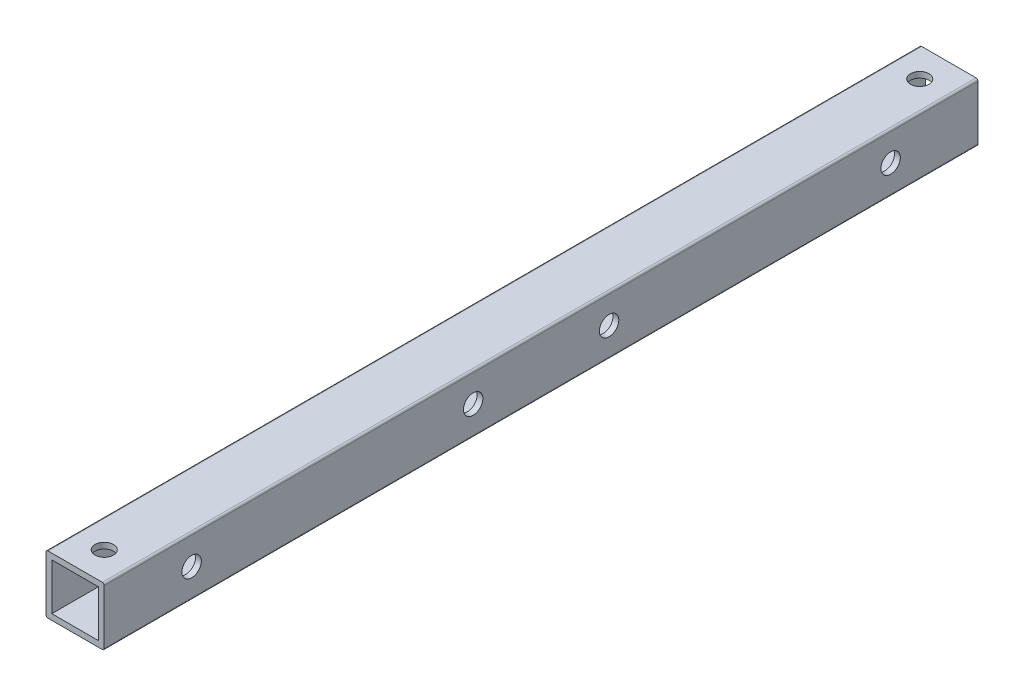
ISO-10303-21;
HEADER;
FILE_DESCRIPTION(('STEP AP214'),'2;1');
FILE_NAME('part.step','',(''),(''),'','','');
FILE_SCHEMA(('AUTOMOTIVE_DESIGN { 1 0 10303 214 1 1 1 1 }'));
ENDSEC;
DATA;
#1=APPLICATION_CONTEXT('core data for automotive mechanical design processes');
#2=APPLICATION_PROTOCOL_DEFINITION('international standard','automotive_design',2000,#1);
#3=PRODUCT_CONTEXT('',#1,'mechanical');
#4=PRODUCT('Part','Part','',(#3));
#5=PRODUCT_RELATED_PRODUCT_CATEGORY('part','',(#4));
#6=PRODUCT_DEFINITION_FORMATION('','',#4);
#7=PRODUCT_DEFINITION_CONTEXT('part definition',#1,'design');
#8=PRODUCT_DEFINITION('design','',#6,#7);
#9=PRODUCT_DEFINITION_SHAPE('','',#8);
#10=(LENGTH_UNIT() NAMED_UNIT(*) SI_UNIT(.MILLI.,.METRE.));
#11=(NAMED_UNIT(*) PLANE_ANGLE_UNIT() SI_UNIT($,.RADIAN.));
#12=(NAMED_UNIT(*) SI_UNIT($,.STERADIAN.) SOLID_ANGLE_UNIT());
#13=UNCERTAINTY_MEASURE_WITH_UNIT(LENGTH_MEASURE(1.E-05),#10,'distance_accuracy_value','');
#14=(GEOMETRIC_REPRESENTATION_CONTEXT(3) GLOBAL_UNCERTAINTY_ASSIGNED_CONTEXT((#13)) GLOBAL_UNIT_ASSIGNED_CONTEXT((#10,
#11,#12)) REPRESENTATION_CONTEXT('',''));
#15=CARTESIAN_POINT('',(0.,0.,0.));
#16=DIRECTION('',(0.,0.,1.));
#17=DIRECTION('',(1.,0.,0.));
#18=AXIS2_PLACEMENT_3D('',#15,#16,#17);
#19=CARTESIAN_POINT('',(-14.,-14.,450.));
#20=DIRECTION('',(0.,0.,-1.));
#21=DIRECTION('',(-1.,0.,0.));
#22=AXIS2_PLACEMENT_3D('',#19,#20,#21);
#23=PLANE('',#22);
#24=CARTESIAN_POINT('',(-14.,-14.,450.));
#25=DIRECTION('',(0.,0.,-1.));
#26=DIRECTION('',(-1.,0.,0.));
#27=AXIS2_PLACEMENT_3D('',#24,#25,#26);
#28=CIRCLE('',#27,0.999999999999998);
#29=CARTESIAN_POINT('',(-14.,-15.,450.));
#30=VERTEX_POINT('',#29);
#31=CARTESIAN_POINT('',(-15.,-14.,450.));
#32=VERTEX_POINT('',#31);
#33=EDGE_CURVE('E184',#30,#32,#28,.T.);
#34=ORIENTED_EDGE('',*,*,#33,.F.);
#35=DIRECTION('',(-1.,0.,0.));
#36=VECTOR('',#35,1.);
#37=CARTESIAN_POINT('',(14.,-15.,450.));
#38=LINE('',#37,#36);
#39=CARTESIAN_POINT('',(14.,-15.,450.));
#40=VERTEX_POINT('',#39);
#41=EDGE_CURVE('E202',#40,#30,#38,.T.);
#42=ORIENTED_EDGE('',*,*,#41,.F.);
#43=CARTESIAN_POINT('',(14.,-14.,450.));
#44=DIRECTION('',(0.,0.,-1.));
#45=DIRECTION('',(-1.,0.,0.));
#46=AXIS2_PLACEMENT_3D('',#43,#44,#45);
#47=CIRCLE('',#46,1.);
#48=CARTESIAN_POINT('',(15.,-14.,450.));
#49=VERTEX_POINT('',#48);
#50=EDGE_CURVE('E199',#49,#40,#47,.T.);
#51=ORIENTED_EDGE('',*,*,#50,.F.);
#52=DIRECTION('',(0.,1.,0.));
#53=VECTOR('',#52,1.);
#54=CARTESIAN_POINT('',(15.,-14.,450.));
#55=LINE('',#54,#53);
#56=CARTESIAN_POINT('',(15.,14.,450.));
#57=VERTEX_POINT('',#56);
#58=EDGE_CURVE('E197',#49,#57,#55,.T.);
#59=ORIENTED_EDGE('',*,*,#58,.T.);
#60=CARTESIAN_POINT('',(14.,14.,450.));
#61=DIRECTION('',(0.,0.,1.));
#62=DIRECTION('',(1.,0.,0.));
#63=AXIS2_PLACEMENT_3D('',#60,#61,#62);
#64=CIRCLE('',#63,0.999999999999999);
#65=CARTESIAN_POINT('',(14.,15.,450.));
#66=VERTEX_POINT('',#65);
#67=EDGE_CURVE('E195',#57,#66,#64,.T.);
#68=ORIENTED_EDGE('',*,*,#67,.T.);
#69=DIRECTION('',(1.,0.,0.));
#70=VECTOR('',#69,1.);
#71=CARTESIAN_POINT('',(-14.,15.,450.));
#72=LINE('',#71,#70);
#73=CARTESIAN_POINT('',(-14.,15.,450.));
#74=VERTEX_POINT('',#73);
#75=EDGE_CURVE('E192',#74,#66,#72,.T.);
#76=ORIENTED_EDGE('',*,*,#75,.F.);
#77=CARTESIAN_POINT('',(-14.,14.,450.));
#78=DIRECTION('',(0.,0.,-1.));
#79=DIRECTION('',(-1.,0.,0.));
#80=AXIS2_PLACEMENT_3D('',#77,#78,#79);
#81=CIRCLE('',#80,0.999999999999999);
#82=CARTESIAN_POINT('',(-15.,14.,450.));
#83=VERTEX_POINT('',#82);
#84=EDGE_CURVE('E189',#83,#74,#81,.T.);
#85=ORIENTED_EDGE('',*,*,#84,.F.);
#86=DIRECTION('',(0.,-1.,0.));
#87=VECTOR('',#86,1.);
#88=CARTESIAN_POINT('',(-15.,14.,450.));
#89=LINE('',#88,#87);
#90=EDGE_CURVE('E187',#83,#32,#89,.T.);
#91=ORIENTED_EDGE('',*,*,#90,.T.);
#92=EDGE_LOOP('',(#34,#42,#51,#59,#68,#76,#85,#91));
#93=FACE_BOUND('',#92,.T.);
#94=DIRECTION('',(0.,-1.,0.));
#95=VECTOR('',#94,1.);
#96=CARTESIAN_POINT('',(-12.,-14.,450.));
#97=LINE('',#96,#95);
#98=CARTESIAN_POINT('',(-12.,12.,450.));
#99=VERTEX_POINT('',#98);
#100=CARTESIAN_POINT('',(-12.,-12.,450.));
#101=VERTEX_POINT('',#100);
#102=EDGE_CURVE('E123',#99,#101,#97,.T.);
#103=ORIENTED_EDGE('',*,*,#102,.F.);
#104=DIRECTION('',(1.,0.,0.));
#105=VECTOR('',#104,1.);
#106=CARTESIAN_POINT('',(-14.,12.,450.));
#107=LINE('',#106,#105);
#108=CARTESIAN_POINT('',(12.,12.,450.));
#109=VERTEX_POINT('',#108);
#110=EDGE_CURVE('E155',#99,#109,#107,.T.);
#111=ORIENTED_EDGE('',*,*,#110,.T.);
#112=DIRECTION('',(0.,1.,0.));
#113=VECTOR('',#112,1.);
#114=CARTESIAN_POINT('',(12.,-14.,450.));
#115=LINE('',#114,#113);
#116=CARTESIAN_POINT('',(12.,-12.,450.));
#117=VERTEX_POINT('',#116);
#118=EDGE_CURVE('E153',#117,#109,#115,.T.);
#119=ORIENTED_EDGE('',*,*,#118,.F.);
#120=DIRECTION('',(-1.,0.,0.));
#121=VECTOR('',#120,1.);
#122=CARTESIAN_POINT('',(-14.,-12.,450.));
#123=LINE('',#122,#121);
#124=EDGE_CURVE('E151',#117,#101,#123,.T.);
#125=ORIENTED_EDGE('',*,*,#124,.T.);
#126=EDGE_LOOP('',(#103,#111,#119,#125));
#127=FACE_BOUND('',#126,.T.);
#128=ADVANCED_FACE('F30',(#93,#127),#23,.F.);
#129=CARTESIAN_POINT('',(-14.,-14.,0.));
#130=DIRECTION('',(0.,0.,-1.));
#131=DIRECTION('',(-1.,0.,0.));
#132=AXIS2_PLACEMENT_3D('',#129,#130,#131);
#133=PLANE('',#132);
#134=CARTESIAN_POINT('',(-14.,-14.,0.));
#135=DIRECTION('',(0.,0.,-1.));
#136=DIRECTION('',(-1.,0.,0.));
#137=AXIS2_PLACEMENT_3D('',#134,#135,#136);
#138=CIRCLE('',#137,0.999999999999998);
#139=CARTESIAN_POINT('',(-14.,-15.,0.));
#140=VERTEX_POINT('',#139);
#141=CARTESIAN_POINT('',(-15.,-14.,0.));
#142=VERTEX_POINT('',#141);
#143=EDGE_CURVE('E127',#140,#142,#138,.T.);
#144=ORIENTED_EDGE('',*,*,#143,.T.);
#145=DIRECTION('',(0.,-1.,0.));
#146=VECTOR('',#145,1.);
#147=CARTESIAN_POINT('',(-15.,14.,0.));
#148=LINE('',#147,#146);
#149=CARTESIAN_POINT('',(-15.,14.,0.));
#150=VERTEX_POINT('',#149);
#151=EDGE_CURVE('E164',#150,#142,#148,.T.);
#152=ORIENTED_EDGE('',*,*,#151,.F.);
#153=CARTESIAN_POINT('',(-14.,14.,0.));
#154=DIRECTION('',(0.,0.,-1.));
#155=DIRECTION('',(-1.,0.,0.));
#156=AXIS2_PLACEMENT_3D('',#153,#154,#155);
#157=CIRCLE('',#156,0.999999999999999);
#158=CARTESIAN_POINT('',(-14.,15.,0.));
#159=VERTEX_POINT('',#158);
#160=EDGE_CURVE('E167',#150,#159,#157,.T.);
#161=ORIENTED_EDGE('',*,*,#160,.T.);
#162=DIRECTION('',(1.,0.,0.));
#163=VECTOR('',#162,1.);
#164=CARTESIAN_POINT('',(-14.,15.,0.));
#165=LINE('',#164,#163);
#166=CARTESIAN_POINT('',(14.,15.,0.));
#167=VERTEX_POINT('',#166);
#168=EDGE_CURVE('E170',#159,#167,#165,.T.);
#169=ORIENTED_EDGE('',*,*,#168,.T.);
#170=CARTESIAN_POINT('',(14.,14.,0.));
#171=DIRECTION('',(0.,0.,1.));
#172=DIRECTION('',(1.,0.,0.));
#173=AXIS2_PLACEMENT_3D('',#170,#171,#172);
#174=CIRCLE('',#173,0.999999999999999);
#175=CARTESIAN_POINT('',(15.,14.,0.));
#176=VERTEX_POINT('',#175);
#177=EDGE_CURVE('E173',#176,#167,#174,.T.);
#178=ORIENTED_EDGE('',*,*,#177,.F.);
#179=DIRECTION('',(0.,1.,0.));
#180=VECTOR('',#179,1.);
#181=CARTESIAN_POINT('',(15.,-14.,0.));
#182=LINE('',#181,#180);
#183=CARTESIAN_POINT('',(15.,-14.,0.));
#184=VERTEX_POINT('',#183);
#185=EDGE_CURVE('E176',#184,#176,#182,.T.);
#186=ORIENTED_EDGE('',*,*,#185,.F.);
#187=CARTESIAN_POINT('',(14.,-14.,0.));
#188=DIRECTION('',(0.,0.,-1.));
#189=DIRECTION('',(-1.,0.,0.));
#190=AXIS2_PLACEMENT_3D('',#187,#188,#189);
#191=CIRCLE('',#190,1.);
#192=CARTESIAN_POINT('',(14.,-15.,0.));
#193=VERTEX_POINT('',#192);
#194=EDGE_CURVE('E178',#184,#193,#191,.T.);
#195=ORIENTED_EDGE('',*,*,#194,.T.);
#196=DIRECTION('',(-1.,0.,0.));
#197=VECTOR('',#196,1.);
#198=CARTESIAN_POINT('',(14.,-15.,0.));
#199=LINE('',#198,#197);
#200=EDGE_CURVE('E181',#193,#140,#199,.T.);
#201=ORIENTED_EDGE('',*,*,#200,.T.);
#202=EDGE_LOOP('',(#144,#152,#161,#169,#178,#186,#195,#201));
#203=FACE_BOUND('',#202,.T.);
#204=DIRECTION('',(1.,0.,0.));
#205=VECTOR('',#204,1.);
#206=CARTESIAN_POINT('',(-14.,12.,0.));
#207=LINE('',#206,#205);
#208=CARTESIAN_POINT('',(-12.,12.,0.));
#209=VERTEX_POINT('',#208);
#210=CARTESIAN_POINT('',(12.,12.,0.));
#211=VERTEX_POINT('',#210);
#212=EDGE_CURVE('E140',#209,#211,#207,.T.);
#213=ORIENTED_EDGE('',*,*,#212,.F.);
#214=DIRECTION('',(0.,-1.,0.));
#215=VECTOR('',#214,1.);
#216=CARTESIAN_POINT('',(-12.,-14.,0.));
#217=LINE('',#216,#215);
#218=CARTESIAN_POINT('',(-12.,-12.,0.));
#219=VERTEX_POINT('',#218);
#220=EDGE_CURVE('E55',#209,#219,#217,.T.);
#221=ORIENTED_EDGE('',*,*,#220,.T.);
#222=DIRECTION('',(-1.,0.,0.));
#223=VECTOR('',#222,1.);
#224=CARTESIAN_POINT('',(-14.,-12.,0.));
#225=LINE('',#224,#223);
#226=CARTESIAN_POINT('',(12.,-12.,0.));
#227=VERTEX_POINT('',#226);
#228=EDGE_CURVE('E131',#227,#219,#225,.T.);
#229=ORIENTED_EDGE('',*,*,#228,.F.);
#230=DIRECTION('',(0.,1.,0.));
#231=VECTOR('',#230,1.);
#232=CARTESIAN_POINT('',(12.,-14.,0.));
#233=LINE('',#232,#231);
#234=EDGE_CURVE('E136',#227,#211,#233,.T.);
#235=ORIENTED_EDGE('',*,*,#234,.T.);
#236=EDGE_LOOP('',(#213,#221,#229,#235));
#237=FACE_BOUND('',#236,.T.);
#238=ADVANCED_FACE('F139',(#203,#237),#133,.T.);
#239=CARTESIAN_POINT('',(-14.,-14.,450.));
#240=DIRECTION('',(0.,0.,-1.));
#241=DIRECTION('',(-1.,0.,0.));
#242=AXIS2_PLACEMENT_3D('',#239,#240,#241);
#243=CYLINDRICAL_SURFACE('',#242,0.999999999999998);
#244=ORIENTED_EDGE('',*,*,#143,.F.);
#245=DIRECTION('',(0.,0.,-1.));
#246=VECTOR('',#245,1.);
#247=CARTESIAN_POINT('',(-14.,-15.,450.));
#248=LINE('',#247,#246);
#249=EDGE_CURVE('E11',#30,#140,#248,.T.);
#250=ORIENTED_EDGE('',*,*,#249,.F.);
#251=ORIENTED_EDGE('',*,*,#33,.T.);
#252=DIRECTION('',(0.,0.,-1.));
#253=VECTOR('',#252,1.);
#254=CARTESIAN_POINT('',(-15.,-14.,450.));
#255=LINE('',#254,#253);
#256=EDGE_CURVE('E204',#32,#142,#255,.T.);
#257=ORIENTED_EDGE('',*,*,#256,.T.);
#258=EDGE_LOOP('',(#244,#250,#251,#257));
#259=FACE_BOUND('',#258,.T.);
#260=ADVANCED_FACE('F32',(#259),#243,.T.);
#261=CARTESIAN_POINT('',(14.,-15.,450.));
#262=DIRECTION('',(0.,-1.,0.));
#263=DIRECTION('',(1.,0.,0.));
#264=AXIS2_PLACEMENT_3D('',#261,#262,#263);
#265=PLANE('',#264);
#266=ORIENTED_EDGE('',*,*,#200,.F.);
#267=DIRECTION('',(0.,0.,-1.));
#268=VECTOR('',#267,1.);
#269=CARTESIAN_POINT('',(14.,-15.,450.));
#270=LINE('',#269,#268);
#271=EDGE_CURVE('E39',#40,#193,#270,.T.);
#272=ORIENTED_EDGE('',*,*,#271,.F.);
#273=ORIENTED_EDGE('',*,*,#41,.T.);
#274=ORIENTED_EDGE('',*,*,#249,.T.);
#275=EDGE_LOOP('',(#266,#272,#273,#274));
#276=FACE_BOUND('',#275,.T.);
#277=ADVANCED_FACE('F299',(#276),#265,.T.);
#278=CARTESIAN_POINT('',(14.,-14.,450.));
#279=DIRECTION('',(0.,0.,-1.));
#280=DIRECTION('',(-1.,0.,0.));
#281=AXIS2_PLACEMENT_3D('',#278,#279,#280);
#282=CYLINDRICAL_SURFACE('',#281,1.);
#283=ORIENTED_EDGE('',*,*,#194,.F.);
#284=DIRECTION('',(0.,0.,-1.));
#285=VECTOR('',#284,1.);
#286=CARTESIAN_POINT('',(15.,-14.,450.));
#287=LINE('',#286,#285);
#288=EDGE_CURVE('E207',#49,#184,#287,.T.);
#289=ORIENTED_EDGE('',*,*,#288,.F.);
#290=ORIENTED_EDGE('',*,*,#50,.T.);
#291=ORIENTED_EDGE('',*,*,#271,.T.);
#292=EDGE_LOOP('',(#283,#289,#290,#291));
#293=FACE_BOUND('',#292,.T.);
#294=ADVANCED_FACE('F302',(#293),#282,.T.);
#295=CARTESIAN_POINT('',(15.,-14.,450.));
#296=DIRECTION('',(-1.,0.,0.));
#297=DIRECTION('',(0.,-1.,0.));
#298=AXIS2_PLACEMENT_3D('',#295,#296,#297);
#299=PLANE('',#298);
#300=CARTESIAN_POINT('',(15.,0.,45.));
#301=DIRECTION('',(-1.,0.,0.));
#302=DIRECTION('',(0.,-1.,0.));
#303=AXIS2_PLACEMENT_3D('',#300,#301,#302);
#304=CIRCLE('',#303,5.);
#305=CARTESIAN_POINT('',(15.,-5.,45.));
#306=VERTEX_POINT('',#305);
#307=EDGE_CURVE('E239',#306,#306,#304,.T.);
#308=ORIENTED_EDGE('',*,*,#307,.T.);
#309=EDGE_LOOP('',(#308));
#310=FACE_BOUND('',#309,.T.);
#311=CARTESIAN_POINT('',(15.,0.,260.));
#312=DIRECTION('',(-1.,0.,0.));
#313=DIRECTION('',(0.,-1.,0.));
#314=AXIS2_PLACEMENT_3D('',#311,#312,#313);
#315=CIRCLE('',#314,4.99999999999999);
#316=CARTESIAN_POINT('',(15.,-4.99999999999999,260.));
#317=VERTEX_POINT('',#316);
#318=EDGE_CURVE('E257',#317,#317,#315,.T.);
#319=ORIENTED_EDGE('',*,*,#318,.T.);
#320=EDGE_LOOP('',(#319));
#321=FACE_BOUND('',#320,.T.);
#322=CARTESIAN_POINT('',(15.,0.,190.));
#323=DIRECTION('',(-1.,0.,0.));
#324=DIRECTION('',(0.,-1.,0.));
#325=AXIS2_PLACEMENT_3D('',#322,#323,#324);
#326=CIRCLE('',#325,4.99999999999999);
#327=CARTESIAN_POINT('',(15.,-4.99999999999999,190.));
#328=VERTEX_POINT('',#327);
#329=EDGE_CURVE('E264',#328,#328,#326,.T.);
#330=ORIENTED_EDGE('',*,*,#329,.T.);
#331=EDGE_LOOP('',(#330));
#332=FACE_BOUND('',#331,.T.);
#333=CARTESIAN_POINT('',(15.,0.,405.));
#334=DIRECTION('',(-1.,0.,0.));
#335=DIRECTION('',(0.,-1.,0.));
#336=AXIS2_PLACEMENT_3D('',#333,#334,#335);
#337=CIRCLE('',#336,4.99999999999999);
#338=CARTESIAN_POINT('',(15.,-4.99999999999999,405.));
#339=VERTEX_POINT('',#338);
#340=EDGE_CURVE('E141',#339,#339,#337,.T.);
#341=ORIENTED_EDGE('',*,*,#340,.T.);
#342=EDGE_LOOP('',(#341));
#343=FACE_BOUND('',#342,.T.);
#344=ORIENTED_EDGE('',*,*,#185,.T.);
#345=DIRECTION('',(0.,0.,-1.));
#346=VECTOR('',#345,1.);
#347=CARTESIAN_POINT('',(15.,14.,450.));
#348=LINE('',#347,#346);
#349=EDGE_CURVE('E209',#57,#176,#348,.T.);
#350=ORIENTED_EDGE('',*,*,#349,.F.);
#351=ORIENTED_EDGE('',*,*,#58,.F.);
#352=ORIENTED_EDGE('',*,*,#288,.T.);
#353=EDGE_LOOP('',(#344,#350,#351,#352));
#354=FACE_BOUND('',#353,.T.);
#355=ADVANCED_FACE('F306',(#310,#321,#332,#343,#354),#299,.F.);
#356=CARTESIAN_POINT('',(14.,14.,450.));
#357=DIRECTION('',(0.,0.,-1.));
#358=DIRECTION('',(-1.,0.,0.));
#359=AXIS2_PLACEMENT_3D('',#356,#357,#358);
#360=CYLINDRICAL_SURFACE('',#359,0.999999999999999);
#361=ORIENTED_EDGE('',*,*,#177,.T.);
#362=DIRECTION('',(0.,0.,-1.));
#363=VECTOR('',#362,1.);
#364=CARTESIAN_POINT('',(14.,15.,450.));
#365=LINE('',#364,#363);
#366=EDGE_CURVE('E212',#66,#167,#365,.T.);
#367=ORIENTED_EDGE('',*,*,#366,.F.);
#368=ORIENTED_EDGE('',*,*,#67,.F.);
#369=ORIENTED_EDGE('',*,*,#349,.T.);
#370=EDGE_LOOP('',(#361,#367,#368,#369));
#371=FACE_BOUND('',#370,.T.);
#372=ADVANCED_FACE('F310',(#371),#360,.T.);
#373=CARTESIAN_POINT('',(-14.,15.,450.));
#374=DIRECTION('',(0.,1.,0.));
#375=DIRECTION('',(0.,0.,1.));
#376=AXIS2_PLACEMENT_3D('',#373,#374,#375);
#377=PLANE('',#376);
#378=CARTESIAN_POINT('',(0.,15.,15.));
#379=DIRECTION('',(0.,1.,0.));
#380=DIRECTION('',(0.,0.,1.));
#381=AXIS2_PLACEMENT_3D('',#378,#379,#380);
#382=CIRCLE('',#381,4.75);
#383=CARTESIAN_POINT('',(0.,15.,19.75));
#384=VERTEX_POINT('',#383);
#385=EDGE_CURVE('E539',#384,#384,#382,.T.);
#386=ORIENTED_EDGE('',*,*,#385,.F.);
#387=EDGE_LOOP('',(#386));
#388=FACE_BOUND('',#387,.T.);
#389=CARTESIAN_POINT('',(0.,15.,435.));
#390=DIRECTION('',(0.,1.,0.));
#391=DIRECTION('',(0.,0.,1.));
#392=AXIS2_PLACEMENT_3D('',#389,#390,#391);
#393=CIRCLE('',#392,4.75);
#394=CARTESIAN_POINT('',(0.,15.,439.75));
#395=VERTEX_POINT('',#394);
#396=EDGE_CURVE('E247',#395,#395,#393,.T.);
#397=ORIENTED_EDGE('',*,*,#396,.F.);
#398=EDGE_LOOP('',(#397));
#399=FACE_BOUND('',#398,.T.);
#400=ORIENTED_EDGE('',*,*,#168,.F.);
#401=DIRECTION('',(0.,0.,-1.));
#402=VECTOR('',#401,1.);
#403=CARTESIAN_POINT('',(-14.,15.,450.));
#404=LINE('',#403,#402);
#405=EDGE_CURVE('E214',#74,#159,#404,.T.);
#406=ORIENTED_EDGE('',*,*,#405,.F.);
#407=ORIENTED_EDGE('',*,*,#75,.T.);
#408=ORIENTED_EDGE('',*,*,#366,.T.);
#409=EDGE_LOOP('',(#400,#406,#407,#408));
#410=FACE_BOUND('',#409,.T.);
#411=ADVANCED_FACE('F314',(#388,#399,#410),#377,.T.);
#412=CARTESIAN_POINT('',(-14.,14.,450.));
#413=DIRECTION('',(0.,0.,-1.));
#414=DIRECTION('',(-1.,0.,0.));
#415=AXIS2_PLACEMENT_3D('',#412,#413,#414);
#416=CYLINDRICAL_SURFACE('',#415,0.999999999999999);
#417=ORIENTED_EDGE('',*,*,#160,.F.);
#418=DIRECTION('',(0.,0.,-1.));
#419=VECTOR('',#418,1.);
#420=CARTESIAN_POINT('',(-15.,14.,450.));
#421=LINE('',#420,#419);
#422=EDGE_CURVE('E216',#83,#150,#421,.T.);
#423=ORIENTED_EDGE('',*,*,#422,.F.);
#424=ORIENTED_EDGE('',*,*,#84,.T.);
#425=ORIENTED_EDGE('',*,*,#405,.T.);
#426=EDGE_LOOP('',(#417,#423,#424,#425));
#427=FACE_BOUND('',#426,.T.);
#428=ADVANCED_FACE('F284',(#427),#416,.T.);
#429=CARTESIAN_POINT('',(-15.,14.,450.));
#430=DIRECTION('',(1.,0.,0.));
#431=DIRECTION('',(0.,1.,0.));
#432=AXIS2_PLACEMENT_3D('',#429,#430,#431);
#433=PLANE('',#432);
#434=CARTESIAN_POINT('',(-15.,0.,45.));
#435=DIRECTION('',(-1.,0.,0.));
#436=DIRECTION('',(0.,-1.,0.));
#437=AXIS2_PLACEMENT_3D('',#434,#435,#436);
#438=CIRCLE('',#437,5.);
#439=CARTESIAN_POINT('',(-15.,-4.99999999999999,45.));
#440=VERTEX_POINT('',#439);
#441=EDGE_CURVE('E235',#440,#440,#438,.T.);
#442=ORIENTED_EDGE('',*,*,#441,.F.);
#443=EDGE_LOOP('',(#442));
#444=FACE_BOUND('',#443,.T.);
#445=CARTESIAN_POINT('',(-15.,0.,260.));
#446=DIRECTION('',(-1.,0.,0.));
#447=DIRECTION('',(0.,-1.,0.));
#448=AXIS2_PLACEMENT_3D('',#445,#446,#447);
#449=CIRCLE('',#448,4.99999999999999);
#450=CARTESIAN_POINT('',(-15.,-4.99999999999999,260.));
#451=VERTEX_POINT('',#450);
#452=EDGE_CURVE('E231',#451,#451,#449,.T.);
#453=ORIENTED_EDGE('',*,*,#452,.F.);
#454=EDGE_LOOP('',(#453));
#455=FACE_BOUND('',#454,.T.);
#456=CARTESIAN_POINT('',(-15.,0.,190.));
#457=DIRECTION('',(-1.,0.,0.));
#458=DIRECTION('',(0.,-1.,0.));
#459=AXIS2_PLACEMENT_3D('',#456,#457,#458);
#460=CIRCLE('',#459,4.99999999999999);
#461=CARTESIAN_POINT('',(-15.,-4.99999999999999,190.));
#462=VERTEX_POINT('',#461);
#463=EDGE_CURVE('E227',#462,#462,#460,.T.);
#464=ORIENTED_EDGE('',*,*,#463,.F.);
#465=EDGE_LOOP('',(#464));
#466=FACE_BOUND('',#465,.T.);
#467=CARTESIAN_POINT('',(-15.,0.,405.));
#468=DIRECTION('',(-1.,0.,0.));
#469=DIRECTION('',(0.,-1.,0.));
#470=AXIS2_PLACEMENT_3D('',#467,#468,#469);
#471=CIRCLE('',#470,4.99999999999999);
#472=CARTESIAN_POINT('',(-15.,-4.99999999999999,405.));
#473=VERTEX_POINT('',#472);
#474=EDGE_CURVE('E222',#473,#473,#471,.T.);
#475=ORIENTED_EDGE('',*,*,#474,.F.);
#476=EDGE_LOOP('',(#475));
#477=FACE_BOUND('',#476,.T.);
#478=ORIENTED_EDGE('',*,*,#151,.T.);
#479=ORIENTED_EDGE('',*,*,#256,.F.);
#480=ORIENTED_EDGE('',*,*,#90,.F.);
#481=ORIENTED_EDGE('',*,*,#422,.T.);
#482=EDGE_LOOP('',(#478,#479,#480,#481));
#483=FACE_BOUND('',#482,.T.);
#484=ADVANCED_FACE('F275',(#444,#455,#466,#477,#483),#433,.F.);
#485=CARTESIAN_POINT('',(-12.,-14.,450.));
#486=DIRECTION('',(1.,0.,0.));
#487=DIRECTION('',(0.,1.,0.));
#488=AXIS2_PLACEMENT_3D('',#485,#486,#487);
#489=PLANE('',#488);
#490=CARTESIAN_POINT('',(-12.,0.,45.));
#491=DIRECTION('',(1.,0.,0.));
#492=DIRECTION('',(0.,1.,0.));
#493=AXIS2_PLACEMENT_3D('',#490,#491,#492);
#494=CIRCLE('',#493,5.);
#495=CARTESIAN_POINT('',(-12.,5.,45.));
#496=VERTEX_POINT('',#495);
#497=EDGE_CURVE('E234',#496,#496,#494,.T.);
#498=ORIENTED_EDGE('',*,*,#497,.F.);
#499=EDGE_LOOP('',(#498));
#500=FACE_BOUND('',#499,.T.);
#501=CARTESIAN_POINT('',(-12.,0.,260.));
#502=DIRECTION('',(1.,0.,0.));
#503=DIRECTION('',(0.,1.,0.));
#504=AXIS2_PLACEMENT_3D('',#501,#502,#503);
#505=CIRCLE('',#504,4.99999999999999);
#506=CARTESIAN_POINT('',(-12.,4.99999999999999,260.));
#507=VERTEX_POINT('',#506);
#508=EDGE_CURVE('E230',#507,#507,#505,.T.);
#509=ORIENTED_EDGE('',*,*,#508,.F.);
#510=EDGE_LOOP('',(#509));
#511=FACE_BOUND('',#510,.T.);
#512=CARTESIAN_POINT('',(-12.,0.,190.));
#513=DIRECTION('',(1.,0.,0.));
#514=DIRECTION('',(0.,1.,0.));
#515=AXIS2_PLACEMENT_3D('',#512,#513,#514);
#516=CIRCLE('',#515,4.99999999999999);
#517=CARTESIAN_POINT('',(-12.,4.99999999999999,190.));
#518=VERTEX_POINT('',#517);
#519=EDGE_CURVE('E226',#518,#518,#516,.T.);
#520=ORIENTED_EDGE('',*,*,#519,.F.);
#521=EDGE_LOOP('',(#520));
#522=FACE_BOUND('',#521,.T.);
#523=CARTESIAN_POINT('',(-12.,0.,405.));
#524=DIRECTION('',(1.,0.,0.));
#525=DIRECTION('',(0.,1.,0.));
#526=AXIS2_PLACEMENT_3D('',#523,#524,#525);
#527=CIRCLE('',#526,4.99999999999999);
#528=CARTESIAN_POINT('',(-12.,4.99999999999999,405.));
#529=VERTEX_POINT('',#528);
#530=EDGE_CURVE('E144',#529,#529,#527,.T.);
#531=ORIENTED_EDGE('',*,*,#530,.F.);
#532=EDGE_LOOP('',(#531));
#533=FACE_BOUND('',#532,.T.);
#534=ORIENTED_EDGE('',*,*,#220,.F.);
#535=DIRECTION('',(0.,0.,-1.));
#536=VECTOR('',#535,1.);
#537=CARTESIAN_POINT('',(-12.,12.,450.));
#538=LINE('',#537,#536);
#539=EDGE_CURVE('E158',#99,#209,#538,.T.);
#540=ORIENTED_EDGE('',*,*,#539,.F.);
#541=ORIENTED_EDGE('',*,*,#102,.T.);
#542=DIRECTION('',(0.,0.,-1.));
#543=VECTOR('',#542,1.);
#544=CARTESIAN_POINT('',(-12.,-12.,450.));
#545=LINE('',#544,#543);
#546=EDGE_CURVE('E119',#101,#219,#545,.T.);
#547=ORIENTED_EDGE('',*,*,#546,.T.);
#548=EDGE_LOOP('',(#534,#540,#541,#547));
#549=FACE_BOUND('',#548,.T.);
#550=ADVANCED_FACE('F121',(#500,#511,#522,#533,#549),#489,.T.);
#551=CARTESIAN_POINT('',(-14.,-12.,450.));
#552=DIRECTION('',(0.,-1.,0.));
#553=DIRECTION('',(1.,0.,0.));
#554=AXIS2_PLACEMENT_3D('',#551,#552,#553);
#555=PLANE('',#554);
#556=ORIENTED_EDGE('',*,*,#228,.T.);
#557=ORIENTED_EDGE('',*,*,#546,.F.);
#558=ORIENTED_EDGE('',*,*,#124,.F.);
#559=DIRECTION('',(0.,0.,-1.));
#560=VECTOR('',#559,1.);
#561=CARTESIAN_POINT('',(12.,-12.,450.));
#562=LINE('',#561,#560);
#563=EDGE_CURVE('E128',#117,#227,#562,.T.);
#564=ORIENTED_EDGE('',*,*,#563,.T.);
#565=EDGE_LOOP('',(#556,#557,#558,#564));
#566=FACE_BOUND('',#565,.T.);
#567=ADVANCED_FACE('F132',(#566),#555,.F.);
#568=CARTESIAN_POINT('',(12.,-14.,450.));
#569=DIRECTION('',(-1.,0.,0.));
#570=DIRECTION('',(0.,-1.,0.));
#571=AXIS2_PLACEMENT_3D('',#568,#569,#570);
#572=PLANE('',#571);
#573=CARTESIAN_POINT('',(12.,0.,45.));
#574=DIRECTION('',(-1.,0.,0.));
#575=DIRECTION('',(0.,-1.,0.));
#576=AXIS2_PLACEMENT_3D('',#573,#574,#575);
#577=CIRCLE('',#576,5.);
#578=CARTESIAN_POINT('',(12.,-5.,45.));
#579=VERTEX_POINT('',#578);
#580=EDGE_CURVE('E232',#579,#579,#577,.T.);
#581=ORIENTED_EDGE('',*,*,#580,.F.);
#582=EDGE_LOOP('',(#581));
#583=FACE_BOUND('',#582,.T.);
#584=CARTESIAN_POINT('',(12.,0.,260.));
#585=DIRECTION('',(-1.,0.,0.));
#586=DIRECTION('',(0.,-1.,0.));
#587=AXIS2_PLACEMENT_3D('',#584,#585,#586);
#588=CIRCLE('',#587,4.99999999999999);
#589=CARTESIAN_POINT('',(12.,-4.99999999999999,260.));
#590=VERTEX_POINT('',#589);
#591=EDGE_CURVE('E228',#590,#590,#588,.T.);
#592=ORIENTED_EDGE('',*,*,#591,.F.);
#593=EDGE_LOOP('',(#592));
#594=FACE_BOUND('',#593,.T.);
#595=CARTESIAN_POINT('',(12.,0.,190.));
#596=DIRECTION('',(-1.,0.,0.));
#597=DIRECTION('',(0.,-1.,0.));
#598=AXIS2_PLACEMENT_3D('',#595,#596,#597);
#599=CIRCLE('',#598,4.99999999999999);
#600=CARTESIAN_POINT('',(12.,-4.99999999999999,190.));
#601=VERTEX_POINT('',#600);
#602=EDGE_CURVE('E223',#601,#601,#599,.T.);
#603=ORIENTED_EDGE('',*,*,#602,.F.);
#604=EDGE_LOOP('',(#603));
#605=FACE_BOUND('',#604,.T.);
#606=CARTESIAN_POINT('',(12.,0.,405.));
#607=DIRECTION('',(-1.,0.,0.));
#608=DIRECTION('',(0.,-1.,0.));
#609=AXIS2_PLACEMENT_3D('',#606,#607,#608);
#610=CIRCLE('',#609,4.99999999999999);
#611=CARTESIAN_POINT('',(12.,-4.99999999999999,405.));
#612=VERTEX_POINT('',#611);
#613=EDGE_CURVE('E219',#612,#612,#610,.T.);
#614=ORIENTED_EDGE('',*,*,#613,.F.);
#615=EDGE_LOOP('',(#614));
#616=FACE_BOUND('',#615,.T.);
#617=ORIENTED_EDGE('',*,*,#234,.F.);
#618=ORIENTED_EDGE('',*,*,#563,.F.);
#619=ORIENTED_EDGE('',*,*,#118,.T.);
#620=DIRECTION('',(0.,0.,-1.));
#621=VECTOR('',#620,1.);
#622=CARTESIAN_POINT('',(12.,12.,450.));
#623=LINE('',#622,#621);
#624=EDGE_CURVE('E47',#109,#211,#623,.T.);
#625=ORIENTED_EDGE('',*,*,#624,.T.);
#626=EDGE_LOOP('',(#617,#618,#619,#625));
#627=FACE_BOUND('',#626,.T.);
#628=ADVANCED_FACE('F282',(#583,#594,#605,#616,#627),#572,.T.);
#629=CARTESIAN_POINT('',(-14.,12.,450.));
#630=DIRECTION('',(0.,1.,0.));
#631=DIRECTION('',(0.,0.,1.));
#632=AXIS2_PLACEMENT_3D('',#629,#630,#631);
#633=PLANE('',#632);
#634=CARTESIAN_POINT('',(0.,12.,15.));
#635=DIRECTION('',(0.,1.,0.));
#636=DIRECTION('',(0.,0.,1.));
#637=AXIS2_PLACEMENT_3D('',#634,#635,#636);
#638=CIRCLE('',#637,4.75);
#639=CARTESIAN_POINT('',(0.,12.,19.75));
#640=VERTEX_POINT('',#639);
#641=EDGE_CURVE('E34',#640,#640,#638,.T.);
#642=ORIENTED_EDGE('',*,*,#641,.T.);
#643=EDGE_LOOP('',(#642));
#644=FACE_BOUND('',#643,.T.);
#645=CARTESIAN_POINT('',(0.,12.,435.));
#646=DIRECTION('',(0.,1.,0.));
#647=DIRECTION('',(0.,0.,1.));
#648=AXIS2_PLACEMENT_3D('',#645,#646,#647);
#649=CIRCLE('',#648,4.75);
#650=CARTESIAN_POINT('',(0.,12.,439.75));
#651=VERTEX_POINT('',#650);
#652=EDGE_CURVE('E242',#651,#651,#649,.T.);
#653=ORIENTED_EDGE('',*,*,#652,.T.);
#654=EDGE_LOOP('',(#653));
#655=FACE_BOUND('',#654,.T.);
#656=ORIENTED_EDGE('',*,*,#212,.T.);
#657=ORIENTED_EDGE('',*,*,#624,.F.);
#658=ORIENTED_EDGE('',*,*,#110,.F.);
#659=ORIENTED_EDGE('',*,*,#539,.T.);
#660=EDGE_LOOP('',(#656,#657,#658,#659));
#661=FACE_BOUND('',#660,.T.);
#662=ADVANCED_FACE('F384',(#644,#655,#661),#633,.F.);
#663=CARTESIAN_POINT('',(25.,0.,405.));
#664=DIRECTION('',(-1.,0.,0.));
#665=DIRECTION('',(0.,-1.,0.));
#666=AXIS2_PLACEMENT_3D('',#663,#664,#665);
#667=CYLINDRICAL_SURFACE('',#666,4.99999999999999);
#668=ORIENTED_EDGE('',*,*,#613,.T.);
#669=EDGE_LOOP('',(#668));
#670=FACE_BOUND('',#669,.T.);
#671=ORIENTED_EDGE('',*,*,#340,.F.);
#672=EDGE_LOOP('',(#671));
#673=FACE_BOUND('',#672,.T.);
#674=ADVANCED_FACE('F389',(#670,#673),#667,.F.);
#675=ORIENTED_EDGE('',*,*,#530,.T.);
#676=EDGE_LOOP('',(#675));
#677=FACE_BOUND('',#676,.T.);
#678=ORIENTED_EDGE('',*,*,#474,.T.);
#679=EDGE_LOOP('',(#678));
#680=FACE_BOUND('',#679,.T.);
#681=ADVANCED_FACE('F271',(#677,#680),#667,.F.);
#682=CARTESIAN_POINT('',(25.,0.,190.));
#683=DIRECTION('',(-1.,0.,0.));
#684=DIRECTION('',(0.,-1.,0.));
#685=AXIS2_PLACEMENT_3D('',#682,#683,#684);
#686=CYLINDRICAL_SURFACE('',#685,4.99999999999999);
#687=ORIENTED_EDGE('',*,*,#602,.T.);
#688=EDGE_LOOP('',(#687));
#689=FACE_BOUND('',#688,.T.);
#690=ORIENTED_EDGE('',*,*,#329,.F.);
#691=EDGE_LOOP('',(#690));
#692=FACE_BOUND('',#691,.T.);
#693=ADVANCED_FACE('F430',(#689,#692),#686,.F.);
#694=ORIENTED_EDGE('',*,*,#519,.T.);
#695=EDGE_LOOP('',(#694));
#696=FACE_BOUND('',#695,.T.);
#697=ORIENTED_EDGE('',*,*,#463,.T.);
#698=EDGE_LOOP('',(#697));
#699=FACE_BOUND('',#698,.T.);
#700=ADVANCED_FACE('F428',(#696,#699),#686,.F.);
#701=CARTESIAN_POINT('',(25.,0.,260.));
#702=DIRECTION('',(-1.,0.,0.));
#703=DIRECTION('',(0.,-1.,0.));
#704=AXIS2_PLACEMENT_3D('',#701,#702,#703);
#705=CYLINDRICAL_SURFACE('',#704,4.99999999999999);
#706=ORIENTED_EDGE('',*,*,#591,.T.);
#707=EDGE_LOOP('',(#706));
#708=FACE_BOUND('',#707,.T.);
#709=ORIENTED_EDGE('',*,*,#318,.F.);
#710=EDGE_LOOP('',(#709));
#711=FACE_BOUND('',#710,.T.);
#712=ADVANCED_FACE('F425',(#708,#711),#705,.F.);
#713=ORIENTED_EDGE('',*,*,#508,.T.);
#714=EDGE_LOOP('',(#713));
#715=FACE_BOUND('',#714,.T.);
#716=ORIENTED_EDGE('',*,*,#452,.T.);
#717=EDGE_LOOP('',(#716));
#718=FACE_BOUND('',#717,.T.);
#719=ADVANCED_FACE('F424',(#715,#718),#705,.F.);
#720=CARTESIAN_POINT('',(25.,0.,45.));
#721=DIRECTION('',(-1.,0.,0.));
#722=DIRECTION('',(0.,-1.,0.));
#723=AXIS2_PLACEMENT_3D('',#720,#721,#722);
#724=CYLINDRICAL_SURFACE('',#723,5.);
#725=ORIENTED_EDGE('',*,*,#580,.T.);
#726=EDGE_LOOP('',(#725));
#727=FACE_BOUND('',#726,.T.);
#728=ORIENTED_EDGE('',*,*,#307,.F.);
#729=EDGE_LOOP('',(#728));
#730=FACE_BOUND('',#729,.T.);
#731=ADVANCED_FACE('F421',(#727,#730),#724,.F.);
#732=ORIENTED_EDGE('',*,*,#497,.T.);
#733=EDGE_LOOP('',(#732));
#734=FACE_BOUND('',#733,.T.);
#735=ORIENTED_EDGE('',*,*,#441,.T.);
#736=EDGE_LOOP('',(#735));
#737=FACE_BOUND('',#736,.T.);
#738=ADVANCED_FACE('F379',(#734,#737),#724,.F.);
#739=CARTESIAN_POINT('',(0.,5.,435.));
#740=DIRECTION('',(0.,1.,0.));
#741=DIRECTION('',(0.,0.,1.));
#742=AXIS2_PLACEMENT_3D('',#739,#740,#741);
#743=CYLINDRICAL_SURFACE('',#742,4.75);
#744=ORIENTED_EDGE('',*,*,#396,.T.);
#745=EDGE_LOOP('',(#744));
#746=FACE_BOUND('',#745,.T.);
#747=ORIENTED_EDGE('',*,*,#652,.F.);
#748=EDGE_LOOP('',(#747));
#749=FACE_BOUND('',#748,.T.);
#750=ADVANCED_FACE('F399',(#746,#749),#743,.F.);
#751=CARTESIAN_POINT('',(0.,5.,15.));
#752=DIRECTION('',(0.,1.,0.));
#753=DIRECTION('',(0.,0.,1.));
#754=AXIS2_PLACEMENT_3D('',#751,#752,#753);
#755=CYLINDRICAL_SURFACE('',#754,4.75);
#756=ORIENTED_EDGE('',*,*,#385,.T.);
#757=EDGE_LOOP('',(#756));
#758=FACE_BOUND('',#757,.T.);
#759=ORIENTED_EDGE('',*,*,#641,.F.);
#760=EDGE_LOOP('',(#759));
#761=FACE_BOUND('',#760,.T.);
#762=ADVANCED_FACE('F404',(#758,#761),#755,.F.);
#763=CLOSED_SHELL('',(#128,#238,#260,#277,#294,#355,#372,#411,#428,#484,#550,#567,#628,#662,
#674,#681,#693,#700,#712,#719,#731,#738,#750,#762));
#764=MANIFOLD_SOLID_BREP('B2',#763);
#765=ADVANCED_BREP_SHAPE_REPRESENTATION('',(#18,#764),#14);
#766=SHAPE_DEFINITION_REPRESENTATION(#9,#765);
ENDSEC;
END-ISO-10303-21;
